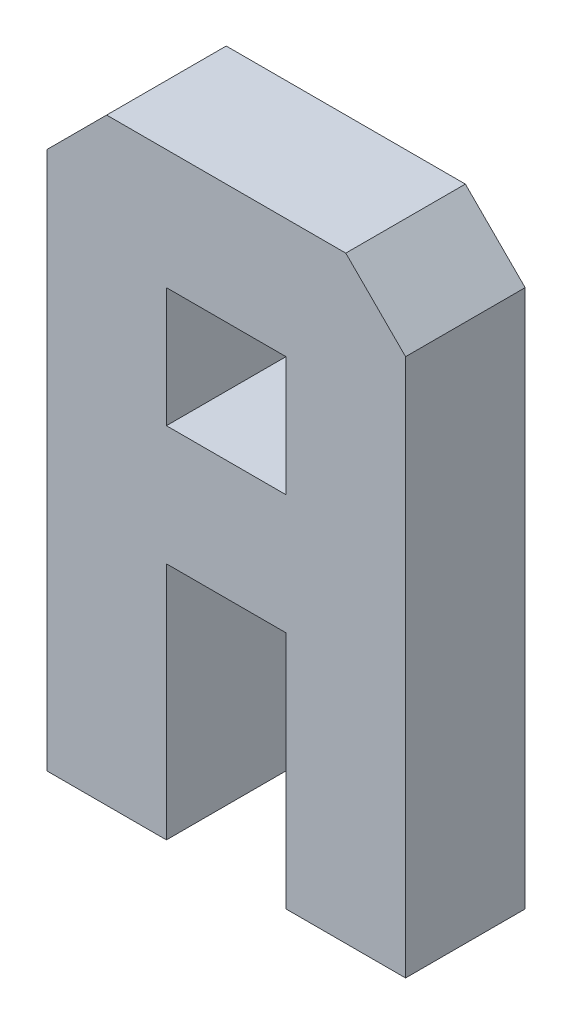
from build123d import *

# Parameters (mm, degrees)
ESQUISSE1_W        = 10
ESQUISSE1_H        = 10
BOSS_EXTRU_1_DEPTH = 10
CHANFREIN1_SIZE    = 5


with BuildPart() as part:
    # Esquisse1 → Boss.-Extru.1 (new body)
    with BuildSketch(Plane.XY):
        Polygon((0, 0), (0, 50), (30, 50), (30, 0), (20, 0), (20, 20), (10, 20), (10, 0), align=None)
        with Locations((15, 35)):
            Rectangle(ESQUISSE1_W, ESQUISSE1_H, mode=Mode.SUBTRACT)
    extrude(amount=BOSS_EXTRU_1_DEPTH)

    # Chanfrein1
    chanfrein1_edges = [part.edges().sort_by_distance(p)[0] for p in [
        (0, 50, 5),
        (30, 50, 5),
    ]]
    chamfer(chanfrein1_edges, length=CHANFREIN1_SIZE)


solid = part.part
